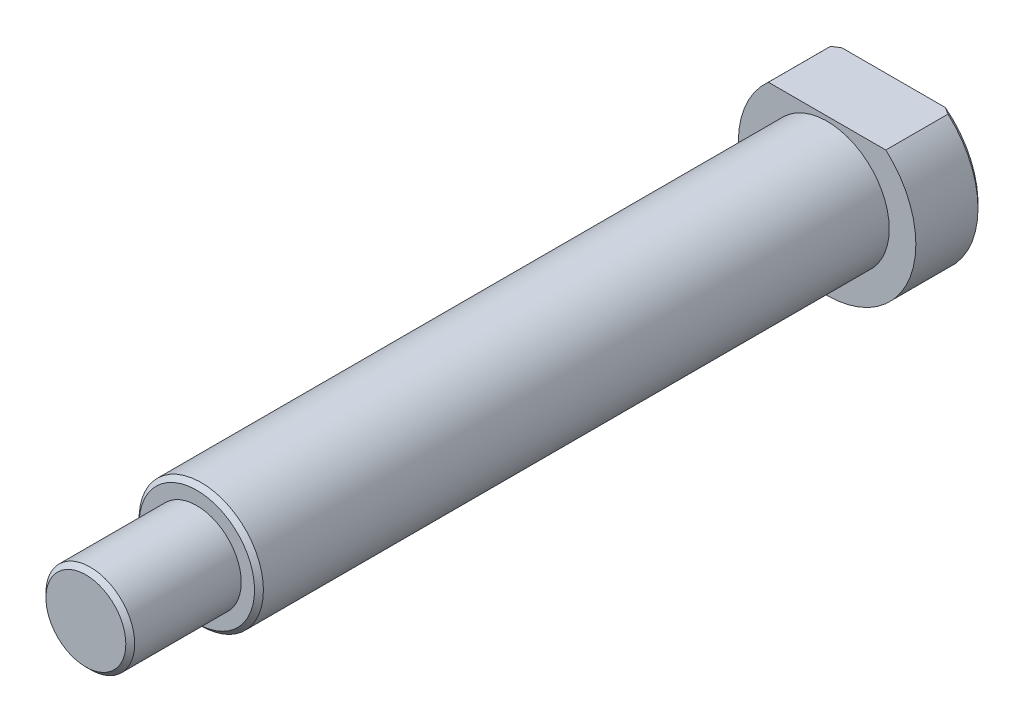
from build123d import *

# Parameters (mm, degrees)
BASE_EXTRUSION_DEPTH = 15
ESQUISSE2_R          = 14
BOSS_EXTRU_1_DEPTH   = 142
ESQUISSE3_R          = 10
BOSS_EXTRU_2_DEPTH   = 25
CHANFREIN1_SIZE      = 1


with BuildPart() as part:
    # Esquisse1 → Base-Extrusion (new body)
    with BuildSketch(Plane.XY):
        with BuildLine():
            Line((-13.228756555, 15), (13.228756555, 15))
            ThreePointArc((13.228756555, 15), (0, -20), (-13.228756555, 15))
        make_face()
    extrude(amount=BASE_EXTRUSION_DEPTH)

    # Esquisse2 → Boss.-Extru.1 (add)
    with BuildSketch(Plane.XY.offset(15)):
        Circle(ESQUISSE2_R)
    extrude(amount=BOSS_EXTRU_1_DEPTH)

    # Esquisse3 → Boss.-Extru.2 (add)
    with BuildSketch(Plane.XY.offset(157)):
        Circle(ESQUISSE3_R)
    extrude(amount=BOSS_EXTRU_2_DEPTH)

    # Chanfrein1
    chanfrein1_edges = [part.edges().sort_by_distance(p)[0] for p in [
        (0, -20, 0),
        (-14, 0, 157),
        (-10, 0, 182),
    ]]
    chamfer(chanfrein1_edges, length=CHANFREIN1_SIZE)


solid = part.part
